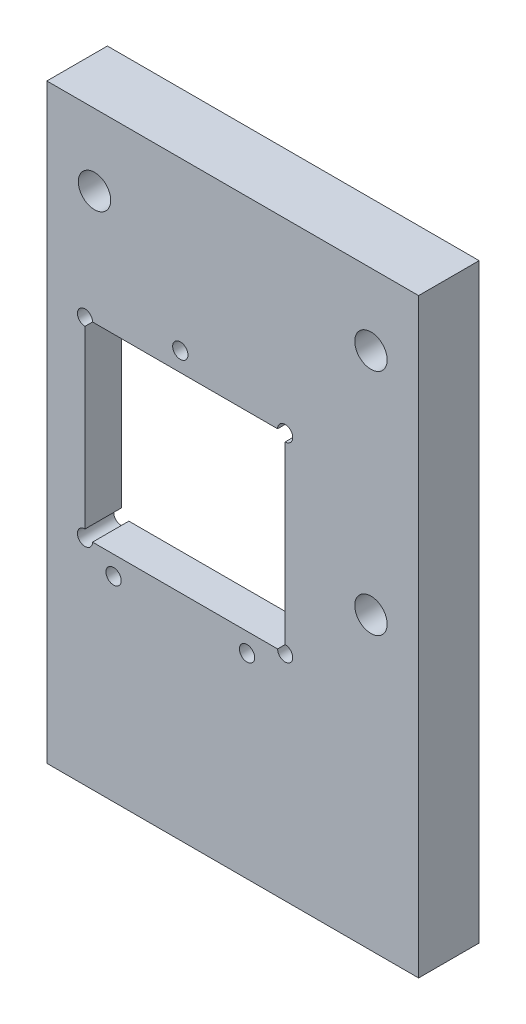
ISO-10303-21;
HEADER;
FILE_DESCRIPTION(('STEP AP214'),'2;1');
FILE_NAME('part.step','',(''),(''),'','','');
FILE_SCHEMA(('AUTOMOTIVE_DESIGN { 1 0 10303 214 1 1 1 1 }'));
ENDSEC;
DATA;
#1=APPLICATION_CONTEXT('core data for automotive mechanical design processes');
#2=APPLICATION_PROTOCOL_DEFINITION('international standard','automotive_design',2000,#1);
#3=PRODUCT_CONTEXT('',#1,'mechanical');
#4=PRODUCT('Part','Part','',(#3));
#5=PRODUCT_RELATED_PRODUCT_CATEGORY('part','',(#4));
#6=PRODUCT_DEFINITION_FORMATION('','',#4);
#7=PRODUCT_DEFINITION_CONTEXT('part definition',#1,'design');
#8=PRODUCT_DEFINITION('design','',#6,#7);
#9=PRODUCT_DEFINITION_SHAPE('','',#8);
#10=(LENGTH_UNIT() NAMED_UNIT(*) SI_UNIT(.MILLI.,.METRE.));
#11=(NAMED_UNIT(*) PLANE_ANGLE_UNIT() SI_UNIT($,.RADIAN.));
#12=(NAMED_UNIT(*) SI_UNIT($,.STERADIAN.) SOLID_ANGLE_UNIT());
#13=UNCERTAINTY_MEASURE_WITH_UNIT(LENGTH_MEASURE(1.E-05),#10,'distance_accuracy_value','');
#14=(GEOMETRIC_REPRESENTATION_CONTEXT(3) GLOBAL_UNCERTAINTY_ASSIGNED_CONTEXT((#13)) GLOBAL_UNIT_ASSIGNED_CONTEXT((#10,
#11,#12)) REPRESENTATION_CONTEXT('',''));
#15=CARTESIAN_POINT('',(0.,0.,0.));
#16=DIRECTION('',(0.,0.,1.));
#17=DIRECTION('',(1.,0.,0.));
#18=AXIS2_PLACEMENT_3D('',#15,#16,#17);
#19=CARTESIAN_POINT('',(1.49999999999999,-10.5,6.35));
#20=DIRECTION('',(0.,0.,1.));
#21=DIRECTION('',(1.,0.,0.));
#22=AXIS2_PLACEMENT_3D('',#19,#20,#21);
#23=CYLINDRICAL_SURFACE('',#22,0.799999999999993);
#24=CARTESIAN_POINT('',(1.49999999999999,-10.5,6.35));
#25=DIRECTION('',(0.,0.,1.));
#26=DIRECTION('',(1.,0.,0.));
#27=AXIS2_PLACEMENT_3D('',#24,#25,#26);
#28=CIRCLE('',#27,0.799999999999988);
#29=CARTESIAN_POINT('',(2.29999999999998,-10.5,6.35));
#30=VERTEX_POINT('',#29);
#31=EDGE_CURVE('E306',#30,#30,#28,.T.);
#32=ORIENTED_EDGE('',*,*,#31,.T.);
#33=EDGE_LOOP('',(#32));
#34=FACE_BOUND('',#33,.T.);
#35=CARTESIAN_POINT('',(1.49999999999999,-10.5,2.54));
#36=DIRECTION('',(0.,0.,-1.));
#37=DIRECTION('',(-1.,0.,0.));
#38=AXIS2_PLACEMENT_3D('',#35,#36,#37);
#39=CIRCLE('',#38,0.799999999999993);
#40=CARTESIAN_POINT('',(0.699999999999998,-10.5,2.54));
#41=VERTEX_POINT('',#40);
#42=EDGE_CURVE('E239',#41,#41,#39,.F.);
#43=ORIENTED_EDGE('',*,*,#42,.F.);
#44=EDGE_LOOP('',(#43));
#45=FACE_BOUND('',#44,.T.);
#46=ADVANCED_FACE('F37',(#34,#45),#23,.F.);
#47=CARTESIAN_POINT('',(-12.5,-10.5,6.35));
#48=DIRECTION('',(0.,0.,1.));
#49=DIRECTION('',(1.,0.,0.));
#50=AXIS2_PLACEMENT_3D('',#47,#48,#49);
#51=CYLINDRICAL_SURFACE('',#50,0.799999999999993);
#52=CARTESIAN_POINT('',(-12.5,-10.5,6.35));
#53=DIRECTION('',(0.,0.,1.));
#54=DIRECTION('',(1.,0.,0.));
#55=AXIS2_PLACEMENT_3D('',#52,#53,#54);
#56=CIRCLE('',#55,0.799999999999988);
#57=CARTESIAN_POINT('',(-11.7,-10.5,6.35));
#58=VERTEX_POINT('',#57);
#59=EDGE_CURVE('E303',#58,#58,#56,.T.);
#60=ORIENTED_EDGE('',*,*,#59,.T.);
#61=EDGE_LOOP('',(#60));
#62=FACE_BOUND('',#61,.T.);
#63=CARTESIAN_POINT('',(-12.5,-10.5,2.54));
#64=DIRECTION('',(0.,0.,-1.));
#65=DIRECTION('',(-1.,0.,0.));
#66=AXIS2_PLACEMENT_3D('',#63,#64,#65);
#67=CIRCLE('',#66,0.799999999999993);
#68=CARTESIAN_POINT('',(-13.3,-10.5,2.54));
#69=VERTEX_POINT('',#68);
#70=EDGE_CURVE('E236',#69,#69,#67,.F.);
#71=ORIENTED_EDGE('',*,*,#70,.F.);
#72=EDGE_LOOP('',(#71));
#73=FACE_BOUND('',#72,.T.);
#74=ADVANCED_FACE('F465',(#62,#73),#51,.F.);
#75=CARTESIAN_POINT('',(-5.50000000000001,13.5,6.35));
#76=DIRECTION('',(0.,0.,1.));
#77=DIRECTION('',(1.,0.,0.));
#78=AXIS2_PLACEMENT_3D('',#75,#76,#77);
#79=CYLINDRICAL_SURFACE('',#78,0.799999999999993);
#80=CARTESIAN_POINT('',(-5.50000000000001,13.5,6.35));
#81=DIRECTION('',(0.,0.,1.));
#82=DIRECTION('',(1.,0.,0.));
#83=AXIS2_PLACEMENT_3D('',#80,#81,#82);
#84=CIRCLE('',#83,0.799999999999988);
#85=CARTESIAN_POINT('',(-4.70000000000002,13.5,6.35));
#86=VERTEX_POINT('',#85);
#87=EDGE_CURVE('E300',#86,#86,#84,.T.);
#88=ORIENTED_EDGE('',*,*,#87,.T.);
#89=EDGE_LOOP('',(#88));
#90=FACE_BOUND('',#89,.T.);
#91=CARTESIAN_POINT('',(-5.50000000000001,13.5,2.54));
#92=DIRECTION('',(0.,0.,-1.));
#93=DIRECTION('',(-1.,0.,0.));
#94=AXIS2_PLACEMENT_3D('',#91,#92,#93);
#95=CIRCLE('',#94,0.799999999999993);
#96=CARTESIAN_POINT('',(-6.3,13.5,2.54));
#97=VERTEX_POINT('',#96);
#98=EDGE_CURVE('E233',#97,#97,#95,.F.);
#99=ORIENTED_EDGE('',*,*,#98,.F.);
#100=EDGE_LOOP('',(#99));
#101=FACE_BOUND('',#100,.T.);
#102=ADVANCED_FACE('F471',(#90,#101),#79,.F.);
#103=CARTESIAN_POINT('',(-15.5,11.5,0.));
#104=DIRECTION('',(-1.,0.,0.));
#105=DIRECTION('',(0.,-1.,0.));
#106=AXIS2_PLACEMENT_3D('',#103,#104,#105);
#107=PLANE('',#106);
#108=DIRECTION('',(0.,-1.,0.));
#109=VECTOR('',#108,1.);
#110=CARTESIAN_POINT('',(-15.5,11.5,2.54));
#111=LINE('',#110,#109);
#112=CARTESIAN_POINT('',(-15.5,10.70625,2.54));
#113=VERTEX_POINT('',#112);
#114=CARTESIAN_POINT('',(-15.5,-7.70625000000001,2.54));
#115=VERTEX_POINT('',#114);
#116=EDGE_CURVE('E221',#113,#115,#111,.T.);
#117=ORIENTED_EDGE('',*,*,#116,.F.);
#118=DIRECTION('',(0.,0.,1.));
#119=VECTOR('',#118,1.);
#120=CARTESIAN_POINT('',(-15.5,10.70625,6.35));
#121=LINE('',#120,#119);
#122=CARTESIAN_POINT('',(-15.5,10.70625,6.35));
#123=VERTEX_POINT('',#122);
#124=EDGE_CURVE('E271',#113,#123,#121,.T.);
#125=ORIENTED_EDGE('',*,*,#124,.T.);
#126=DIRECTION('',(0.,-1.,0.));
#127=VECTOR('',#126,1.);
#128=CARTESIAN_POINT('',(-15.5,11.5,6.35));
#129=LINE('',#128,#127);
#130=CARTESIAN_POINT('',(-15.5,-7.70625000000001,6.35));
#131=VERTEX_POINT('',#130);
#132=EDGE_CURVE('E289',#123,#131,#129,.T.);
#133=ORIENTED_EDGE('',*,*,#132,.T.);
#134=DIRECTION('',(0.,0.,1.));
#135=VECTOR('',#134,1.);
#136=CARTESIAN_POINT('',(-15.5,-7.70625000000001,6.35));
#137=LINE('',#136,#135);
#138=EDGE_CURVE('E286',#131,#115,#137,.F.);
#139=ORIENTED_EDGE('',*,*,#138,.T.);
#140=EDGE_LOOP('',(#117,#125,#133,#139));
#141=FACE_BOUND('',#140,.T.);
#142=ADVANCED_FACE('F427',(#141),#107,.F.);
#143=CARTESIAN_POINT('',(-15.5,11.5,0.));
#144=DIRECTION('',(0.,1.,0.));
#145=DIRECTION('',(-1.,0.,0.));
#146=AXIS2_PLACEMENT_3D('',#143,#144,#145);
#147=PLANE('',#146);
#148=DIRECTION('',(-1.,0.,0.));
#149=VECTOR('',#148,1.);
#150=CARTESIAN_POINT('',(-15.5,11.5,2.54));
#151=LINE('',#150,#149);
#152=CARTESIAN_POINT('',(4.70624999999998,11.5,2.54));
#153=VERTEX_POINT('',#152);
#154=CARTESIAN_POINT('',(-14.70625,11.5,2.54));
#155=VERTEX_POINT('',#154);
#156=EDGE_CURVE('E214',#153,#155,#151,.T.);
#157=ORIENTED_EDGE('',*,*,#156,.F.);
#158=DIRECTION('',(0.,0.,1.));
#159=VECTOR('',#158,1.);
#160=CARTESIAN_POINT('',(4.70624999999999,11.5,6.35));
#161=LINE('',#160,#159);
#162=CARTESIAN_POINT('',(4.70624999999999,11.5,6.35));
#163=VERTEX_POINT('',#162);
#164=EDGE_CURVE('E276',#153,#163,#161,.T.);
#165=ORIENTED_EDGE('',*,*,#164,.T.);
#166=DIRECTION('',(-1.,0.,0.));
#167=VECTOR('',#166,1.);
#168=CARTESIAN_POINT('',(-15.5,11.5,6.35));
#169=LINE('',#168,#167);
#170=CARTESIAN_POINT('',(-14.70625,11.5,6.35));
#171=VERTEX_POINT('',#170);
#172=EDGE_CURVE('E297',#163,#171,#169,.T.);
#173=ORIENTED_EDGE('',*,*,#172,.T.);
#174=DIRECTION('',(0.,0.,1.));
#175=VECTOR('',#174,1.);
#176=CARTESIAN_POINT('',(-14.70625,11.5,6.35));
#177=LINE('',#176,#175);
#178=EDGE_CURVE('E349',#171,#155,#177,.F.);
#179=ORIENTED_EDGE('',*,*,#178,.T.);
#180=EDGE_LOOP('',(#157,#165,#173,#179));
#181=FACE_BOUND('',#180,.T.);
#182=ADVANCED_FACE('F454',(#181),#147,.F.);
#183=CARTESIAN_POINT('',(5.49999999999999,11.5,0.));
#184=DIRECTION('',(1.,0.,0.));
#185=DIRECTION('',(0.,1.,0.));
#186=AXIS2_PLACEMENT_3D('',#183,#184,#185);
#187=PLANE('',#186);
#188=DIRECTION('',(0.,1.,0.));
#189=VECTOR('',#188,1.);
#190=CARTESIAN_POINT('',(5.49999999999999,11.5,2.54));
#191=LINE('',#190,#189);
#192=CARTESIAN_POINT('',(5.49999999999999,-7.70625000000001,2.54));
#193=VERTEX_POINT('',#192);
#194=CARTESIAN_POINT('',(5.49999999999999,10.70625,2.54));
#195=VERTEX_POINT('',#194);
#196=EDGE_CURVE('E229',#193,#195,#191,.T.);
#197=ORIENTED_EDGE('',*,*,#196,.F.);
#198=DIRECTION('',(0.,0.,1.));
#199=VECTOR('',#198,1.);
#200=CARTESIAN_POINT('',(5.49999999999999,-7.70625000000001,6.35));
#201=LINE('',#200,#199);
#202=CARTESIAN_POINT('',(5.49999999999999,-7.70625000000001,6.35));
#203=VERTEX_POINT('',#202);
#204=EDGE_CURVE('E281',#193,#203,#201,.T.);
#205=ORIENTED_EDGE('',*,*,#204,.T.);
#206=DIRECTION('',(0.,1.,0.));
#207=VECTOR('',#206,1.);
#208=CARTESIAN_POINT('',(5.49999999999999,11.5,6.35));
#209=LINE('',#208,#207);
#210=CARTESIAN_POINT('',(5.49999999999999,10.70625,6.35));
#211=VERTEX_POINT('',#210);
#212=EDGE_CURVE('E294',#203,#211,#209,.T.);
#213=ORIENTED_EDGE('',*,*,#212,.T.);
#214=DIRECTION('',(0.,0.,1.));
#215=VECTOR('',#214,1.);
#216=CARTESIAN_POINT('',(5.49999999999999,10.70625,6.35));
#217=LINE('',#216,#215);
#218=EDGE_CURVE('E346',#211,#195,#217,.F.);
#219=ORIENTED_EDGE('',*,*,#218,.T.);
#220=EDGE_LOOP('',(#197,#205,#213,#219));
#221=FACE_BOUND('',#220,.T.);
#222=ADVANCED_FACE('F447',(#221),#187,.F.);
#223=CARTESIAN_POINT('',(-15.5,-8.50000000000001,0.));
#224=DIRECTION('',(0.,-1.,0.));
#225=DIRECTION('',(0.,0.,-1.));
#226=AXIS2_PLACEMENT_3D('',#223,#224,#225);
#227=PLANE('',#226);
#228=DIRECTION('',(1.,0.,0.));
#229=VECTOR('',#228,1.);
#230=CARTESIAN_POINT('',(-15.5,-8.50000000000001,2.54));
#231=LINE('',#230,#229);
#232=CARTESIAN_POINT('',(-14.70625,-8.50000000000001,2.54));
#233=VERTEX_POINT('',#232);
#234=CARTESIAN_POINT('',(4.70625,-8.50000000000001,2.54));
#235=VERTEX_POINT('',#234);
#236=EDGE_CURVE('E227',#233,#235,#231,.T.);
#237=ORIENTED_EDGE('',*,*,#236,.F.);
#238=DIRECTION('',(0.,0.,1.));
#239=VECTOR('',#238,1.);
#240=CARTESIAN_POINT('',(-14.70625,-8.50000000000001,6.35));
#241=LINE('',#240,#239);
#242=CARTESIAN_POINT('',(-14.70625,-8.50000000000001,6.35));
#243=VERTEX_POINT('',#242);
#244=EDGE_CURVE('E341',#233,#243,#241,.T.);
#245=ORIENTED_EDGE('',*,*,#244,.T.);
#246=DIRECTION('',(1.,0.,0.));
#247=VECTOR('',#246,1.);
#248=CARTESIAN_POINT('',(-15.5,-8.50000000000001,6.35));
#249=LINE('',#248,#247);
#250=CARTESIAN_POINT('',(4.70624999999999,-8.50000000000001,6.35));
#251=VERTEX_POINT('',#250);
#252=EDGE_CURVE('E291',#243,#251,#249,.T.);
#253=ORIENTED_EDGE('',*,*,#252,.T.);
#254=DIRECTION('',(0.,0.,1.));
#255=VECTOR('',#254,1.);
#256=CARTESIAN_POINT('',(4.70624999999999,-8.50000000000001,6.35));
#257=LINE('',#256,#255);
#258=EDGE_CURVE('E343',#251,#235,#257,.F.);
#259=ORIENTED_EDGE('',*,*,#258,.T.);
#260=EDGE_LOOP('',(#237,#245,#253,#259));
#261=FACE_BOUND('',#260,.T.);
#262=ADVANCED_FACE('F438',(#261),#227,.F.);
#263=CARTESIAN_POINT('',(-15.5,-8.50000000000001,6.35));
#264=DIRECTION('',(0.,0.,1.));
#265=DIRECTION('',(1.,0.,0.));
#266=AXIS2_PLACEMENT_3D('',#263,#264,#265);
#267=CYLINDRICAL_SURFACE('',#266,0.793749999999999);
#268=CARTESIAN_POINT('',(-15.5,-8.50000000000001,2.54));
#269=DIRECTION('',(0.,0.,-1.));
#270=DIRECTION('',(-1.,0.,0.));
#271=AXIS2_PLACEMENT_3D('',#268,#269,#270);
#272=CIRCLE('',#271,0.793749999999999);
#273=EDGE_CURVE('E225',#115,#233,#272,.F.);
#274=ORIENTED_EDGE('',*,*,#273,.F.);
#275=ORIENTED_EDGE('',*,*,#138,.F.);
#276=CARTESIAN_POINT('',(-15.5,-8.50000000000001,6.35));
#277=DIRECTION('',(0.,0.,1.));
#278=DIRECTION('',(1.,0.,0.));
#279=AXIS2_PLACEMENT_3D('',#276,#277,#278);
#280=CIRCLE('',#279,0.793749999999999);
#281=EDGE_CURVE('E283',#131,#243,#280,.T.);
#282=ORIENTED_EDGE('',*,*,#281,.T.);
#283=ORIENTED_EDGE('',*,*,#244,.F.);
#284=EDGE_LOOP('',(#274,#275,#282,#283));
#285=FACE_BOUND('',#284,.T.);
#286=ADVANCED_FACE('F431',(#285),#267,.F.);
#287=CARTESIAN_POINT('',(5.49999999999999,-8.50000000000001,6.35));
#288=DIRECTION('',(0.,0.,1.));
#289=DIRECTION('',(1.,0.,0.));
#290=AXIS2_PLACEMENT_3D('',#287,#288,#289);
#291=CYLINDRICAL_SURFACE('',#290,0.793749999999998);
#292=CARTESIAN_POINT('',(5.49999999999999,-8.50000000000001,2.54));
#293=DIRECTION('',(0.,0.,-1.));
#294=DIRECTION('',(-1.,0.,0.));
#295=AXIS2_PLACEMENT_3D('',#292,#293,#294);
#296=CIRCLE('',#295,0.793749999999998);
#297=EDGE_CURVE('E231',#235,#193,#296,.F.);
#298=ORIENTED_EDGE('',*,*,#297,.F.);
#299=ORIENTED_EDGE('',*,*,#258,.F.);
#300=CARTESIAN_POINT('',(5.49999999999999,-8.50000000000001,6.35));
#301=DIRECTION('',(0.,0.,1.));
#302=DIRECTION('',(1.,0.,0.));
#303=AXIS2_PLACEMENT_3D('',#300,#301,#302);
#304=CIRCLE('',#303,0.793749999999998);
#305=EDGE_CURVE('E278',#251,#203,#304,.T.);
#306=ORIENTED_EDGE('',*,*,#305,.T.);
#307=ORIENTED_EDGE('',*,*,#204,.F.);
#308=EDGE_LOOP('',(#298,#299,#306,#307));
#309=FACE_BOUND('',#308,.T.);
#310=ADVANCED_FACE('F441',(#309),#291,.F.);
#311=CARTESIAN_POINT('',(5.49999999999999,11.5,6.35));
#312=DIRECTION('',(0.,0.,1.));
#313=DIRECTION('',(1.,0.,0.));
#314=AXIS2_PLACEMENT_3D('',#311,#312,#313);
#315=CYLINDRICAL_SURFACE('',#314,0.793749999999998);
#316=CARTESIAN_POINT('',(5.49999999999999,11.5,2.54));
#317=DIRECTION('',(0.,0.,-1.));
#318=DIRECTION('',(-1.,0.,0.));
#319=AXIS2_PLACEMENT_3D('',#316,#317,#318);
#320=CIRCLE('',#319,0.793749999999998);
#321=EDGE_CURVE('E223',#195,#153,#320,.F.);
#322=ORIENTED_EDGE('',*,*,#321,.F.);
#323=ORIENTED_EDGE('',*,*,#218,.F.);
#324=CARTESIAN_POINT('',(5.49999999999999,11.5,6.35));
#325=DIRECTION('',(0.,0.,1.));
#326=DIRECTION('',(1.,0.,0.));
#327=AXIS2_PLACEMENT_3D('',#324,#325,#326);
#328=CIRCLE('',#327,0.793749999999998);
#329=EDGE_CURVE('E273',#211,#163,#328,.T.);
#330=ORIENTED_EDGE('',*,*,#329,.T.);
#331=ORIENTED_EDGE('',*,*,#164,.F.);
#332=EDGE_LOOP('',(#322,#323,#330,#331));
#333=FACE_BOUND('',#332,.T.);
#334=ADVANCED_FACE('F452',(#333),#315,.F.);
#335=CARTESIAN_POINT('',(-15.5,11.5,6.35));
#336=DIRECTION('',(0.,0.,1.));
#337=DIRECTION('',(1.,0.,0.));
#338=AXIS2_PLACEMENT_3D('',#335,#336,#337);
#339=CYLINDRICAL_SURFACE('',#338,0.793749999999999);
#340=CARTESIAN_POINT('',(-15.5,11.5,2.54));
#341=DIRECTION('',(0.,0.,-1.));
#342=DIRECTION('',(-1.,0.,0.));
#343=AXIS2_PLACEMENT_3D('',#340,#341,#342);
#344=CIRCLE('',#343,0.793749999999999);
#345=EDGE_CURVE('E352',#155,#113,#344,.F.);
#346=ORIENTED_EDGE('',*,*,#345,.F.);
#347=ORIENTED_EDGE('',*,*,#178,.F.);
#348=CARTESIAN_POINT('',(-15.5,11.5,6.35));
#349=DIRECTION('',(0.,0.,1.));
#350=DIRECTION('',(1.,0.,0.));
#351=AXIS2_PLACEMENT_3D('',#348,#349,#350);
#352=CIRCLE('',#351,0.793749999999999);
#353=EDGE_CURVE('E266',#171,#123,#352,.T.);
#354=ORIENTED_EDGE('',*,*,#353,.T.);
#355=ORIENTED_EDGE('',*,*,#124,.F.);
#356=EDGE_LOOP('',(#346,#347,#354,#355));
#357=FACE_BOUND('',#356,.T.);
#358=ADVANCED_FACE('F410',(#357),#339,.F.);
#359=CARTESIAN_POINT('',(0.,0.,6.35));
#360=DIRECTION('',(0.,0.,-1.));
#361=DIRECTION('',(-1.,0.,0.));
#362=AXIS2_PLACEMENT_3D('',#359,#360,#361);
#363=PLANE('',#362);
#364=CARTESIAN_POINT('',(-14.5,23.5,6.35));
#365=DIRECTION('',(0.,0.,1.));
#366=DIRECTION('',(1.,0.,0.));
#367=AXIS2_PLACEMENT_3D('',#364,#365,#366);
#368=CIRCLE('',#367,1.7);
#369=CARTESIAN_POINT('',(-12.8,23.5,6.35));
#370=VERTEX_POINT('',#369);
#371=EDGE_CURVE('E250',#370,#370,#368,.T.);
#372=ORIENTED_EDGE('',*,*,#371,.F.);
#373=EDGE_LOOP('',(#372));
#374=FACE_BOUND('',#373,.T.);
#375=CARTESIAN_POINT('',(14.5,23.5,6.35));
#376=DIRECTION('',(0.,0.,1.));
#377=DIRECTION('',(1.,0.,0.));
#378=AXIS2_PLACEMENT_3D('',#375,#376,#377);
#379=CIRCLE('',#378,1.69999999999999);
#380=CARTESIAN_POINT('',(16.2,23.5,6.35));
#381=VERTEX_POINT('',#380);
#382=EDGE_CURVE('E254',#381,#381,#379,.T.);
#383=ORIENTED_EDGE('',*,*,#382,.F.);
#384=EDGE_LOOP('',(#383));
#385=FACE_BOUND('',#384,.T.);
#386=CARTESIAN_POINT('',(14.5,-0.500000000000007,6.35));
#387=DIRECTION('',(0.,0.,1.));
#388=DIRECTION('',(1.,0.,0.));
#389=AXIS2_PLACEMENT_3D('',#386,#387,#388);
#390=CIRCLE('',#389,1.7);
#391=CARTESIAN_POINT('',(16.2,-0.500000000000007,6.35));
#392=VERTEX_POINT('',#391);
#393=EDGE_CURVE('E260',#392,#392,#390,.T.);
#394=ORIENTED_EDGE('',*,*,#393,.F.);
#395=EDGE_LOOP('',(#394));
#396=FACE_BOUND('',#395,.T.);
#397=DIRECTION('',(0.,1.,0.));
#398=VECTOR('',#397,1.);
#399=CARTESIAN_POINT('',(19.5,-31.,6.35));
#400=LINE('',#399,#398);
#401=CARTESIAN_POINT('',(19.5,-31.,6.35));
#402=VERTEX_POINT('',#401);
#403=CARTESIAN_POINT('',(19.5,31.,6.35));
#404=VERTEX_POINT('',#403);
#405=EDGE_CURVE('E310',#402,#404,#400,.T.);
#406=ORIENTED_EDGE('',*,*,#405,.T.);
#407=DIRECTION('',(-1.,0.,0.));
#408=VECTOR('',#407,1.);
#409=CARTESIAN_POINT('',(-19.5,31.,6.35));
#410=LINE('',#409,#408);
#411=CARTESIAN_POINT('',(-19.5,31.,6.35));
#412=VERTEX_POINT('',#411);
#413=EDGE_CURVE('E313',#404,#412,#410,.T.);
#414=ORIENTED_EDGE('',*,*,#413,.T.);
#415=DIRECTION('',(0.,-1.,0.));
#416=VECTOR('',#415,1.);
#417=CARTESIAN_POINT('',(-19.5,-31.,6.35));
#418=LINE('',#417,#416);
#419=CARTESIAN_POINT('',(-19.5,-31.,6.35));
#420=VERTEX_POINT('',#419);
#421=EDGE_CURVE('E316',#412,#420,#418,.T.);
#422=ORIENTED_EDGE('',*,*,#421,.T.);
#423=DIRECTION('',(1.,0.,0.));
#424=VECTOR('',#423,1.);
#425=CARTESIAN_POINT('',(-19.5,-31.,6.35));
#426=LINE('',#425,#424);
#427=EDGE_CURVE('E318',#420,#402,#426,.T.);
#428=ORIENTED_EDGE('',*,*,#427,.T.);
#429=EDGE_LOOP('',(#406,#414,#422,#428));
#430=FACE_BOUND('',#429,.T.);
#431=ORIENTED_EDGE('',*,*,#31,.F.);
#432=EDGE_LOOP('',(#431));
#433=FACE_BOUND('',#432,.T.);
#434=ORIENTED_EDGE('',*,*,#59,.F.);
#435=EDGE_LOOP('',(#434));
#436=FACE_BOUND('',#435,.T.);
#437=ORIENTED_EDGE('',*,*,#87,.F.);
#438=EDGE_LOOP('',(#437));
#439=FACE_BOUND('',#438,.T.);
#440=ORIENTED_EDGE('',*,*,#132,.F.);
#441=ORIENTED_EDGE('',*,*,#353,.F.);
#442=ORIENTED_EDGE('',*,*,#172,.F.);
#443=ORIENTED_EDGE('',*,*,#329,.F.);
#444=ORIENTED_EDGE('',*,*,#212,.F.);
#445=ORIENTED_EDGE('',*,*,#305,.F.);
#446=ORIENTED_EDGE('',*,*,#252,.F.);
#447=ORIENTED_EDGE('',*,*,#281,.F.);
#448=EDGE_LOOP('',(#440,#441,#442,#443,#444,#445,#446,#447));
#449=FACE_BOUND('',#448,.T.);
#450=ADVANCED_FACE('F407',(#374,#385,#396,#430,#433,#436,#439,#449),#363,.F.);
#451=CARTESIAN_POINT('',(19.5,-31.,6.35));
#452=DIRECTION('',(-1.,0.,0.));
#453=DIRECTION('',(0.,0.,1.));
#454=AXIS2_PLACEMENT_3D('',#451,#452,#453);
#455=PLANE('',#454);
#456=DIRECTION('',(0.,1.,0.));
#457=VECTOR('',#456,1.);
#458=CARTESIAN_POINT('',(19.5,-31.,0.));
#459=LINE('',#458,#457);
#460=CARTESIAN_POINT('',(19.5,-31.,0.));
#461=VERTEX_POINT('',#460);
#462=CARTESIAN_POINT('',(19.5,31.,0.));
#463=VERTEX_POINT('',#462);
#464=EDGE_CURVE('E309',#461,#463,#459,.T.);
#465=ORIENTED_EDGE('',*,*,#464,.T.);
#466=DIRECTION('',(0.,0.,-1.));
#467=VECTOR('',#466,1.);
#468=CARTESIAN_POINT('',(19.5,31.,6.35));
#469=LINE('',#468,#467);
#470=EDGE_CURVE('E338',#404,#463,#469,.T.);
#471=ORIENTED_EDGE('',*,*,#470,.F.);
#472=ORIENTED_EDGE('',*,*,#405,.F.);
#473=DIRECTION('',(0.,0.,-1.));
#474=VECTOR('',#473,1.);
#475=CARTESIAN_POINT('',(19.5,-31.,6.35));
#476=LINE('',#475,#474);
#477=EDGE_CURVE('E320',#402,#461,#476,.T.);
#478=ORIENTED_EDGE('',*,*,#477,.T.);
#479=EDGE_LOOP('',(#465,#471,#472,#478));
#480=FACE_BOUND('',#479,.T.);
#481=ADVANCED_FACE('F400',(#480),#455,.F.);
#482=CARTESIAN_POINT('',(-19.5,31.,6.35));
#483=DIRECTION('',(0.,-1.,0.));
#484=DIRECTION('',(0.,0.,-1.));
#485=AXIS2_PLACEMENT_3D('',#482,#483,#484);
#486=PLANE('',#485);
#487=DIRECTION('',(-1.,0.,0.));
#488=VECTOR('',#487,1.);
#489=CARTESIAN_POINT('',(-19.5,31.,0.));
#490=LINE('',#489,#488);
#491=CARTESIAN_POINT('',(-19.5,31.,0.));
#492=VERTEX_POINT('',#491);
#493=EDGE_CURVE('E323',#463,#492,#490,.T.);
#494=ORIENTED_EDGE('',*,*,#493,.T.);
#495=DIRECTION('',(0.,0.,-1.));
#496=VECTOR('',#495,1.);
#497=CARTESIAN_POINT('',(-19.5,31.,6.35));
#498=LINE('',#497,#496);
#499=EDGE_CURVE('E335',#412,#492,#498,.T.);
#500=ORIENTED_EDGE('',*,*,#499,.F.);
#501=ORIENTED_EDGE('',*,*,#413,.F.);
#502=ORIENTED_EDGE('',*,*,#470,.T.);
#503=EDGE_LOOP('',(#494,#500,#501,#502));
#504=FACE_BOUND('',#503,.T.);
#505=ADVANCED_FACE('F395',(#504),#486,.F.);
#506=CARTESIAN_POINT('',(-19.5,-31.,6.35));
#507=DIRECTION('',(1.,0.,0.));
#508=DIRECTION('',(0.,0.,-1.));
#509=AXIS2_PLACEMENT_3D('',#506,#507,#508);
#510=PLANE('',#509);
#511=DIRECTION('',(0.,-1.,0.));
#512=VECTOR('',#511,1.);
#513=CARTESIAN_POINT('',(-19.5,-31.,0.));
#514=LINE('',#513,#512);
#515=CARTESIAN_POINT('',(-19.5,17.,0.));
#516=VERTEX_POINT('',#515);
#517=EDGE_CURVE('E326',#492,#516,#514,.T.);
#518=ORIENTED_EDGE('',*,*,#517,.T.);
#519=DIRECTION('',(0.,0.,1.));
#520=VECTOR('',#519,1.);
#521=CARTESIAN_POINT('',(-19.5,17.,6.35));
#522=LINE('',#521,#520);
#523=CARTESIAN_POINT('',(-19.5,17.,2.54));
#524=VERTEX_POINT('',#523);
#525=EDGE_CURVE('E247',#516,#524,#522,.T.);
#526=ORIENTED_EDGE('',*,*,#525,.T.);
#527=DIRECTION('',(0.,1.,0.));
#528=VECTOR('',#527,1.);
#529=CARTESIAN_POINT('',(-19.5,-31.,2.54));
#530=LINE('',#529,#528);
#531=CARTESIAN_POINT('',(-19.5,-14.,2.54));
#532=VERTEX_POINT('',#531);
#533=EDGE_CURVE('E242',#532,#524,#530,.T.);
#534=ORIENTED_EDGE('',*,*,#533,.F.);
#535=DIRECTION('',(0.,0.,-1.));
#536=VECTOR('',#535,1.);
#537=CARTESIAN_POINT('',(-19.5,-14.,6.35));
#538=LINE('',#537,#536);
#539=CARTESIAN_POINT('',(-19.5,-14.,0.));
#540=VERTEX_POINT('',#539);
#541=EDGE_CURVE('E244',#532,#540,#538,.T.);
#542=ORIENTED_EDGE('',*,*,#541,.T.);
#543=CARTESIAN_POINT('',(-19.5,-31.,0.));
#544=VERTEX_POINT('',#543);
#545=EDGE_CURVE('E325',#540,#544,#514,.T.);
#546=ORIENTED_EDGE('',*,*,#545,.T.);
#547=DIRECTION('',(0.,0.,-1.));
#548=VECTOR('',#547,1.);
#549=CARTESIAN_POINT('',(-19.5,-31.,6.35));
#550=LINE('',#549,#548);
#551=EDGE_CURVE('E332',#420,#544,#550,.T.);
#552=ORIENTED_EDGE('',*,*,#551,.F.);
#553=ORIENTED_EDGE('',*,*,#421,.F.);
#554=ORIENTED_EDGE('',*,*,#499,.T.);
#555=EDGE_LOOP('',(#518,#526,#534,#542,#546,#552,#553,#554));
#556=FACE_BOUND('',#555,.T.);
#557=ADVANCED_FACE('F387',(#556),#510,.F.);
#558=CARTESIAN_POINT('',(-19.5,-31.,6.35));
#559=DIRECTION('',(0.,1.,0.));
#560=DIRECTION('',(0.,0.,1.));
#561=AXIS2_PLACEMENT_3D('',#558,#559,#560);
#562=PLANE('',#561);
#563=CARTESIAN_POINT('',(-13.15,-31.,3.175));
#564=DIRECTION('',(0.,-1.,0.));
#565=DIRECTION('',(0.,0.,-1.));
#566=AXIS2_PLACEMENT_3D('',#563,#564,#565);
#567=CIRCLE('',#566,1.1303);
#568=CARTESIAN_POINT('',(-13.15,-31.,2.0447));
#569=VERTEX_POINT('',#568);
#570=EDGE_CURVE('E183',#569,#569,#567,.T.);
#571=ORIENTED_EDGE('',*,*,#570,.F.);
#572=EDGE_LOOP('',(#571));
#573=FACE_BOUND('',#572,.T.);
#574=CARTESIAN_POINT('',(13.15,-31.,3.175));
#575=DIRECTION('',(0.,-1.,0.));
#576=DIRECTION('',(0.,0.,-1.));
#577=AXIS2_PLACEMENT_3D('',#574,#575,#576);
#578=CIRCLE('',#577,1.1303);
#579=CARTESIAN_POINT('',(13.15,-31.,2.0447));
#580=VERTEX_POINT('',#579);
#581=EDGE_CURVE('E182',#580,#580,#578,.T.);
#582=ORIENTED_EDGE('',*,*,#581,.F.);
#583=EDGE_LOOP('',(#582));
#584=FACE_BOUND('',#583,.T.);
#585=CARTESIAN_POINT('',(-6.80000000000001,-31.,3.175));
#586=DIRECTION('',(0.,-1.,0.));
#587=DIRECTION('',(0.,0.,-1.));
#588=AXIS2_PLACEMENT_3D('',#585,#586,#587);
#589=CIRCLE('',#588,1.5875);
#590=CARTESIAN_POINT('',(-6.80000000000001,-31.,1.5875));
#591=VERTEX_POINT('',#590);
#592=EDGE_CURVE('E193',#591,#591,#589,.T.);
#593=ORIENTED_EDGE('',*,*,#592,.F.);
#594=EDGE_LOOP('',(#593));
#595=FACE_BOUND('',#594,.T.);
#596=CARTESIAN_POINT('',(6.79999999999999,-31.,3.175));
#597=DIRECTION('',(0.,-1.,0.));
#598=DIRECTION('',(0.,0.,-1.));
#599=AXIS2_PLACEMENT_3D('',#596,#597,#598);
#600=CIRCLE('',#599,1.5875);
#601=CARTESIAN_POINT('',(6.79999999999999,-31.,1.5875));
#602=VERTEX_POINT('',#601);
#603=EDGE_CURVE('E199',#602,#602,#600,.T.);
#604=ORIENTED_EDGE('',*,*,#603,.F.);
#605=EDGE_LOOP('',(#604));
#606=FACE_BOUND('',#605,.T.);
#607=DIRECTION('',(1.,0.,0.));
#608=VECTOR('',#607,1.);
#609=CARTESIAN_POINT('',(-19.5,-31.,0.));
#610=LINE('',#609,#608);
#611=EDGE_CURVE('E314',#544,#461,#610,.T.);
#612=ORIENTED_EDGE('',*,*,#611,.T.);
#613=ORIENTED_EDGE('',*,*,#477,.F.);
#614=ORIENTED_EDGE('',*,*,#427,.F.);
#615=ORIENTED_EDGE('',*,*,#551,.T.);
#616=EDGE_LOOP('',(#612,#613,#614,#615));
#617=FACE_BOUND('',#616,.T.);
#618=ADVANCED_FACE('F405',(#573,#584,#595,#606,#617),#562,.F.);
#619=CARTESIAN_POINT('',(0.,0.,0.));
#620=DIRECTION('',(0.,0.,-1.));
#621=DIRECTION('',(-1.,0.,0.));
#622=AXIS2_PLACEMENT_3D('',#619,#620,#621);
#623=PLANE('',#622);
#624=DIRECTION('',(1.,0.,0.));
#625=VECTOR('',#624,1.);
#626=CARTESIAN_POINT('',(10.5,17.,0.));
#627=LINE('',#626,#625);
#628=CARTESIAN_POINT('',(9.49999999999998,17.,0.));
#629=VERTEX_POINT('',#628);
#630=EDGE_CURVE('E210',#516,#629,#627,.T.);
#631=ORIENTED_EDGE('',*,*,#630,.F.);
#632=ORIENTED_EDGE('',*,*,#517,.F.);
#633=ORIENTED_EDGE('',*,*,#493,.F.);
#634=ORIENTED_EDGE('',*,*,#464,.F.);
#635=ORIENTED_EDGE('',*,*,#611,.F.);
#636=ORIENTED_EDGE('',*,*,#545,.F.);
#637=DIRECTION('',(-1.,0.,0.));
#638=VECTOR('',#637,1.);
#639=CARTESIAN_POINT('',(10.5,-14.,0.));
#640=LINE('',#639,#638);
#641=CARTESIAN_POINT('',(9.49999999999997,-14.,0.));
#642=VERTEX_POINT('',#641);
#643=EDGE_CURVE('E217',#642,#540,#640,.T.);
#644=ORIENTED_EDGE('',*,*,#643,.F.);
#645=CARTESIAN_POINT('',(9.49999999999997,-13.,0.));
#646=DIRECTION('',(0.,0.,-1.));
#647=DIRECTION('',(-1.,0.,0.));
#648=AXIS2_PLACEMENT_3D('',#645,#646,#647);
#649=CIRCLE('',#648,1.);
#650=CARTESIAN_POINT('',(10.5,-13.,0.));
#651=VERTEX_POINT('',#650);
#652=EDGE_CURVE('E45',#642,#651,#649,.F.);
#653=ORIENTED_EDGE('',*,*,#652,.T.);
#654=DIRECTION('',(0.,-1.,0.));
#655=VECTOR('',#654,1.);
#656=CARTESIAN_POINT('',(10.5,17.,0.));
#657=LINE('',#656,#655);
#658=CARTESIAN_POINT('',(10.5,16.,0.));
#659=VERTEX_POINT('',#658);
#660=EDGE_CURVE('E205',#659,#651,#657,.T.);
#661=ORIENTED_EDGE('',*,*,#660,.F.);
#662=CARTESIAN_POINT('',(9.49999999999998,16.,0.));
#663=DIRECTION('',(0.,0.,-1.));
#664=DIRECTION('',(-1.,0.,0.));
#665=AXIS2_PLACEMENT_3D('',#662,#663,#664);
#666=CIRCLE('',#665,1.);
#667=EDGE_CURVE('E11',#659,#629,#666,.F.);
#668=ORIENTED_EDGE('',*,*,#667,.T.);
#669=EDGE_LOOP('',(#631,#632,#633,#634,#635,#636,#644,#653,#661,#668));
#670=FACE_BOUND('',#669,.T.);
#671=CARTESIAN_POINT('',(-14.5,23.5,0.));
#672=DIRECTION('',(0.,0.,1.));
#673=DIRECTION('',(1.,0.,0.));
#674=AXIS2_PLACEMENT_3D('',#671,#672,#673);
#675=CIRCLE('',#674,1.7);
#676=CARTESIAN_POINT('',(-12.8,23.5,0.));
#677=VERTEX_POINT('',#676);
#678=EDGE_CURVE('E251',#677,#677,#675,.T.);
#679=ORIENTED_EDGE('',*,*,#678,.T.);
#680=EDGE_LOOP('',(#679));
#681=FACE_BOUND('',#680,.T.);
#682=CARTESIAN_POINT('',(14.5,23.5,0.));
#683=DIRECTION('',(0.,0.,1.));
#684=DIRECTION('',(1.,0.,0.));
#685=AXIS2_PLACEMENT_3D('',#682,#683,#684);
#686=CIRCLE('',#685,1.69999999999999);
#687=CARTESIAN_POINT('',(16.2,23.5,0.));
#688=VERTEX_POINT('',#687);
#689=EDGE_CURVE('E257',#688,#688,#686,.T.);
#690=ORIENTED_EDGE('',*,*,#689,.T.);
#691=EDGE_LOOP('',(#690));
#692=FACE_BOUND('',#691,.T.);
#693=CARTESIAN_POINT('',(14.5,-0.500000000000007,0.));
#694=DIRECTION('',(0.,0.,1.));
#695=DIRECTION('',(1.,0.,0.));
#696=AXIS2_PLACEMENT_3D('',#693,#694,#695);
#697=CIRCLE('',#696,1.7);
#698=CARTESIAN_POINT('',(16.2,-0.500000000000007,0.));
#699=VERTEX_POINT('',#698);
#700=EDGE_CURVE('E263',#699,#699,#697,.T.);
#701=ORIENTED_EDGE('',*,*,#700,.T.);
#702=EDGE_LOOP('',(#701));
#703=FACE_BOUND('',#702,.T.);
#704=ADVANCED_FACE('F367',(#670,#681,#692,#703),#623,.T.);
#705=CARTESIAN_POINT('',(14.5,-0.500000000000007,0.));
#706=DIRECTION('',(0.,0.,1.));
#707=DIRECTION('',(1.,0.,0.));
#708=AXIS2_PLACEMENT_3D('',#705,#706,#707);
#709=CYLINDRICAL_SURFACE('',#708,1.7);
#710=ORIENTED_EDGE('',*,*,#700,.F.);
#711=EDGE_LOOP('',(#710));
#712=FACE_BOUND('',#711,.T.);
#713=ORIENTED_EDGE('',*,*,#393,.T.);
#714=EDGE_LOOP('',(#713));
#715=FACE_BOUND('',#714,.T.);
#716=ADVANCED_FACE('F479',(#712,#715),#709,.F.);
#717=CARTESIAN_POINT('',(14.5,23.5,0.));
#718=DIRECTION('',(0.,0.,1.));
#719=DIRECTION('',(1.,0.,0.));
#720=AXIS2_PLACEMENT_3D('',#717,#718,#719);
#721=CYLINDRICAL_SURFACE('',#720,1.69999999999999);
#722=ORIENTED_EDGE('',*,*,#689,.F.);
#723=EDGE_LOOP('',(#722));
#724=FACE_BOUND('',#723,.T.);
#725=ORIENTED_EDGE('',*,*,#382,.T.);
#726=EDGE_LOOP('',(#725));
#727=FACE_BOUND('',#726,.T.);
#728=ADVANCED_FACE('F507',(#724,#727),#721,.F.);
#729=CARTESIAN_POINT('',(-14.5,23.5,0.));
#730=DIRECTION('',(0.,0.,1.));
#731=DIRECTION('',(1.,0.,0.));
#732=AXIS2_PLACEMENT_3D('',#729,#730,#731);
#733=CYLINDRICAL_SURFACE('',#732,1.7);
#734=ORIENTED_EDGE('',*,*,#678,.F.);
#735=EDGE_LOOP('',(#734));
#736=FACE_BOUND('',#735,.T.);
#737=ORIENTED_EDGE('',*,*,#371,.T.);
#738=EDGE_LOOP('',(#737));
#739=FACE_BOUND('',#738,.T.);
#740=ADVANCED_FACE('F504',(#736,#739),#733,.F.);
#741=CARTESIAN_POINT('',(10.5,17.,2.54));
#742=DIRECTION('',(0.,1.,0.));
#743=DIRECTION('',(0.,0.,1.));
#744=AXIS2_PLACEMENT_3D('',#741,#742,#743);
#745=PLANE('',#744);
#746=ORIENTED_EDGE('',*,*,#630,.T.);
#747=DIRECTION('',(0.,0.,-1.));
#748=VECTOR('',#747,1.);
#749=CARTESIAN_POINT('',(9.49999999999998,17.,2.54));
#750=LINE('',#749,#748);
#751=CARTESIAN_POINT('',(9.49999999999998,17.,2.54));
#752=VERTEX_POINT('',#751);
#753=EDGE_CURVE('E57',#629,#752,#750,.F.);
#754=ORIENTED_EDGE('',*,*,#753,.T.);
#755=DIRECTION('',(1.,0.,0.));
#756=VECTOR('',#755,1.);
#757=CARTESIAN_POINT('',(10.5,17.,2.54));
#758=LINE('',#757,#756);
#759=EDGE_CURVE('E212',#524,#752,#758,.T.);
#760=ORIENTED_EDGE('',*,*,#759,.F.);
#761=ORIENTED_EDGE('',*,*,#525,.F.);
#762=EDGE_LOOP('',(#746,#754,#760,#761));
#763=FACE_BOUND('',#762,.T.);
#764=ADVANCED_FACE('F389',(#763),#745,.F.);
#765=CARTESIAN_POINT('',(10.5,-14.,2.54));
#766=DIRECTION('',(0.,-1.,0.));
#767=DIRECTION('',(0.,0.,-1.));
#768=AXIS2_PLACEMENT_3D('',#765,#766,#767);
#769=PLANE('',#768);
#770=DIRECTION('',(-1.,0.,0.));
#771=VECTOR('',#770,1.);
#772=CARTESIAN_POINT('',(10.5,-14.,2.54));
#773=LINE('',#772,#771);
#774=CARTESIAN_POINT('',(9.49999999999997,-14.,2.54));
#775=VERTEX_POINT('',#774);
#776=EDGE_CURVE('E209',#775,#532,#773,.T.);
#777=ORIENTED_EDGE('',*,*,#776,.F.);
#778=DIRECTION('',(0.,0.,-1.));
#779=VECTOR('',#778,1.);
#780=CARTESIAN_POINT('',(9.49999999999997,-14.,0.));
#781=LINE('',#780,#779);
#782=EDGE_CURVE('E354',#775,#642,#781,.T.);
#783=ORIENTED_EDGE('',*,*,#782,.T.);
#784=ORIENTED_EDGE('',*,*,#643,.T.);
#785=ORIENTED_EDGE('',*,*,#541,.F.);
#786=EDGE_LOOP('',(#777,#783,#784,#785));
#787=FACE_BOUND('',#786,.T.);
#788=ADVANCED_FACE('F384',(#787),#769,.F.);
#789=CARTESIAN_POINT('',(0.,0.,2.54));
#790=DIRECTION('',(0.,0.,-1.));
#791=DIRECTION('',(-1.,0.,0.));
#792=AXIS2_PLACEMENT_3D('',#789,#790,#791);
#793=PLANE('',#792);
#794=ORIENTED_EDGE('',*,*,#42,.T.);
#795=EDGE_LOOP('',(#794));
#796=FACE_BOUND('',#795,.T.);
#797=ORIENTED_EDGE('',*,*,#98,.T.);
#798=EDGE_LOOP('',(#797));
#799=FACE_BOUND('',#798,.T.);
#800=ORIENTED_EDGE('',*,*,#297,.T.);
#801=ORIENTED_EDGE('',*,*,#196,.T.);
#802=ORIENTED_EDGE('',*,*,#321,.T.);
#803=ORIENTED_EDGE('',*,*,#156,.T.);
#804=ORIENTED_EDGE('',*,*,#345,.T.);
#805=ORIENTED_EDGE('',*,*,#116,.T.);
#806=ORIENTED_EDGE('',*,*,#273,.T.);
#807=ORIENTED_EDGE('',*,*,#236,.T.);
#808=EDGE_LOOP('',(#800,#801,#802,#803,#804,#805,#806,#807));
#809=FACE_BOUND('',#808,.T.);
#810=ORIENTED_EDGE('',*,*,#70,.T.);
#811=EDGE_LOOP('',(#810));
#812=FACE_BOUND('',#811,.T.);
#813=DIRECTION('',(0.,-1.,0.));
#814=VECTOR('',#813,1.);
#815=CARTESIAN_POINT('',(10.5,17.,2.54));
#816=LINE('',#815,#814);
#817=CARTESIAN_POINT('',(10.5,16.,2.54));
#818=VERTEX_POINT('',#817);
#819=CARTESIAN_POINT('',(10.5,-13.,2.54));
#820=VERTEX_POINT('',#819);
#821=EDGE_CURVE('E206',#818,#820,#816,.T.);
#822=ORIENTED_EDGE('',*,*,#821,.T.);
#823=CARTESIAN_POINT('',(9.49999999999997,-13.,2.54));
#824=DIRECTION('',(0.,0.,-1.));
#825=DIRECTION('',(-1.,0.,0.));
#826=AXIS2_PLACEMENT_3D('',#823,#824,#825);
#827=CIRCLE('',#826,1.);
#828=EDGE_CURVE('E364',#820,#775,#827,.T.);
#829=ORIENTED_EDGE('',*,*,#828,.T.);
#830=ORIENTED_EDGE('',*,*,#776,.T.);
#831=ORIENTED_EDGE('',*,*,#533,.T.);
#832=ORIENTED_EDGE('',*,*,#759,.T.);
#833=CARTESIAN_POINT('',(9.49999999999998,16.,2.54));
#834=DIRECTION('',(0.,0.,-1.));
#835=DIRECTION('',(-1.,0.,0.));
#836=AXIS2_PLACEMENT_3D('',#833,#834,#835);
#837=CIRCLE('',#836,1.);
#838=EDGE_CURVE('E362',#752,#818,#837,.T.);
#839=ORIENTED_EDGE('',*,*,#838,.T.);
#840=EDGE_LOOP('',(#822,#829,#830,#831,#832,#839));
#841=FACE_BOUND('',#840,.T.);
#842=ADVANCED_FACE('F381',(#796,#799,#809,#812,#841),#793,.T.);
#843=CARTESIAN_POINT('',(10.5,17.,2.54));
#844=DIRECTION('',(1.,0.,0.));
#845=DIRECTION('',(0.,1.,0.));
#846=AXIS2_PLACEMENT_3D('',#843,#844,#845);
#847=PLANE('',#846);
#848=ORIENTED_EDGE('',*,*,#660,.T.);
#849=DIRECTION('',(0.,0.,-1.));
#850=VECTOR('',#849,1.);
#851=CARTESIAN_POINT('',(10.5,-13.,2.54));
#852=LINE('',#851,#850);
#853=EDGE_CURVE('E360',#651,#820,#852,.F.);
#854=ORIENTED_EDGE('',*,*,#853,.T.);
#855=ORIENTED_EDGE('',*,*,#821,.F.);
#856=DIRECTION('',(0.,0.,-1.));
#857=VECTOR('',#856,1.);
#858=CARTESIAN_POINT('',(10.5,16.,0.));
#859=LINE('',#858,#857);
#860=EDGE_CURVE('E357',#818,#659,#859,.T.);
#861=ORIENTED_EDGE('',*,*,#860,.T.);
#862=EDGE_LOOP('',(#848,#854,#855,#861));
#863=FACE_BOUND('',#862,.T.);
#864=ADVANCED_FACE('F374',(#863),#847,.F.);
#865=CARTESIAN_POINT('',(9.49999999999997,-13.,2.54));
#866=DIRECTION('',(0.,0.,1.));
#867=DIRECTION('',(1.,0.,0.));
#868=AXIS2_PLACEMENT_3D('',#865,#866,#867);
#869=CYLINDRICAL_SURFACE('',#868,1.);
#870=ORIENTED_EDGE('',*,*,#828,.F.);
#871=ORIENTED_EDGE('',*,*,#853,.F.);
#872=ORIENTED_EDGE('',*,*,#652,.F.);
#873=ORIENTED_EDGE('',*,*,#782,.F.);
#874=EDGE_LOOP('',(#870,#871,#872,#873));
#875=FACE_BOUND('',#874,.T.);
#876=ADVANCED_FACE('F378',(#875),#869,.F.);
#877=CARTESIAN_POINT('',(9.49999999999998,16.,2.54));
#878=DIRECTION('',(0.,0.,1.));
#879=DIRECTION('',(1.,0.,0.));
#880=AXIS2_PLACEMENT_3D('',#877,#878,#879);
#881=CYLINDRICAL_SURFACE('',#880,1.);
#882=ORIENTED_EDGE('',*,*,#838,.F.);
#883=ORIENTED_EDGE('',*,*,#753,.F.);
#884=ORIENTED_EDGE('',*,*,#667,.F.);
#885=ORIENTED_EDGE('',*,*,#860,.F.);
#886=EDGE_LOOP('',(#882,#883,#884,#885));
#887=FACE_BOUND('',#886,.T.);
#888=ADVANCED_FACE('F39',(#887),#881,.F.);
#889=CARTESIAN_POINT('',(6.79999999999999,-24.65,3.175));
#890=DIRECTION('',(0.,-1.,0.));
#891=DIRECTION('',(0.,0.,-1.));
#892=AXIS2_PLACEMENT_3D('',#889,#890,#891);
#893=CONICAL_SURFACE('',#892,1.5875,1.02974425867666);
#894=CARTESIAN_POINT('',(6.79999999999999,-23.6961337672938,3.175));
#895=VERTEX_POINT('',#894);
#896=VERTEX_LOOP('',#895);
#897=FACE_BOUND('',#896,.T.);
#898=CARTESIAN_POINT('',(6.79999999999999,-24.65,3.175));
#899=DIRECTION('',(0.,-1.,0.));
#900=DIRECTION('',(0.,0.,-1.));
#901=AXIS2_PLACEMENT_3D('',#898,#899,#900);
#902=CIRCLE('',#901,1.5875);
#903=CARTESIAN_POINT('',(6.79999999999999,-24.65,1.5875));
#904=VERTEX_POINT('',#903);
#905=EDGE_CURVE('E202',#904,#904,#902,.T.);
#906=ORIENTED_EDGE('',*,*,#905,.T.);
#907=EDGE_LOOP('',(#906));
#908=FACE_BOUND('',#907,.T.);
#909=ADVANCED_FACE('F493',(#897,#908),#893,.F.);
#910=CARTESIAN_POINT('',(6.79999999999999,-31.,3.175));
#911=DIRECTION('',(0.,-1.,0.));
#912=DIRECTION('',(0.,0.,-1.));
#913=AXIS2_PLACEMENT_3D('',#910,#911,#912);
#914=CYLINDRICAL_SURFACE('',#913,1.5875);
#915=ORIENTED_EDGE('',*,*,#905,.F.);
#916=EDGE_LOOP('',(#915));
#917=FACE_BOUND('',#916,.T.);
#918=ORIENTED_EDGE('',*,*,#603,.T.);
#919=EDGE_LOOP('',(#918));
#920=FACE_BOUND('',#919,.T.);
#921=ADVANCED_FACE('F569',(#917,#920),#914,.F.);
#922=CARTESIAN_POINT('',(-6.80000000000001,-24.65,3.175));
#923=DIRECTION('',(0.,-1.,0.));
#924=DIRECTION('',(0.,0.,-1.));
#925=AXIS2_PLACEMENT_3D('',#922,#923,#924);
#926=CONICAL_SURFACE('',#925,1.5875,1.02974425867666);
#927=CARTESIAN_POINT('',(-6.80000000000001,-23.6961337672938,3.175));
#928=VERTEX_POINT('',#927);
#929=VERTEX_LOOP('',#928);
#930=FACE_BOUND('',#929,.T.);
#931=CARTESIAN_POINT('',(-6.80000000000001,-24.65,3.175));
#932=DIRECTION('',(0.,-1.,0.));
#933=DIRECTION('',(0.,0.,-1.));
#934=AXIS2_PLACEMENT_3D('',#931,#932,#933);
#935=CIRCLE('',#934,1.5875);
#936=CARTESIAN_POINT('',(-6.80000000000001,-24.65,1.5875));
#937=VERTEX_POINT('',#936);
#938=EDGE_CURVE('E196',#937,#937,#935,.T.);
#939=ORIENTED_EDGE('',*,*,#938,.T.);
#940=EDGE_LOOP('',(#939));
#941=FACE_BOUND('',#940,.T.);
#942=ADVANCED_FACE('F579',(#930,#941),#926,.F.);
#943=CARTESIAN_POINT('',(-6.80000000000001,-31.,3.175));
#944=DIRECTION('',(0.,-1.,0.));
#945=DIRECTION('',(0.,0.,-1.));
#946=AXIS2_PLACEMENT_3D('',#943,#944,#945);
#947=CYLINDRICAL_SURFACE('',#946,1.5875);
#948=ORIENTED_EDGE('',*,*,#938,.F.);
#949=EDGE_LOOP('',(#948));
#950=FACE_BOUND('',#949,.T.);
#951=ORIENTED_EDGE('',*,*,#592,.T.);
#952=EDGE_LOOP('',(#951));
#953=FACE_BOUND('',#952,.T.);
#954=ADVANCED_FACE('F589',(#950,#953),#947,.F.);
#955=CARTESIAN_POINT('',(13.15,-18.3,3.175));
#956=DIRECTION('',(0.,-1.,0.));
#957=DIRECTION('',(0.,0.,-1.));
#958=AXIS2_PLACEMENT_3D('',#955,#956,#957);
#959=CONICAL_SURFACE('',#958,1.1303,1.02974425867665);
#960=CARTESIAN_POINT('',(13.15,-17.6208472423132,3.175));
#961=VERTEX_POINT('',#960);
#962=VERTEX_LOOP('',#961);
#963=FACE_BOUND('',#962,.T.);
#964=CARTESIAN_POINT('',(13.15,-18.3,3.175));
#965=DIRECTION('',(0.,-1.,0.));
#966=DIRECTION('',(0.,0.,-1.));
#967=AXIS2_PLACEMENT_3D('',#964,#965,#966);
#968=CIRCLE('',#967,1.1303);
#969=CARTESIAN_POINT('',(13.15,-18.3,2.0447));
#970=VERTEX_POINT('',#969);
#971=EDGE_CURVE('E186',#970,#970,#968,.T.);
#972=ORIENTED_EDGE('',*,*,#971,.T.);
#973=EDGE_LOOP('',(#972));
#974=FACE_BOUND('',#973,.T.);
#975=ADVANCED_FACE('F599',(#963,#974),#959,.F.);
#976=CARTESIAN_POINT('',(13.15,-31.,3.175));
#977=DIRECTION('',(0.,-1.,0.));
#978=DIRECTION('',(0.,0.,-1.));
#979=AXIS2_PLACEMENT_3D('',#976,#977,#978);
#980=CYLINDRICAL_SURFACE('',#979,1.1303);
#981=ORIENTED_EDGE('',*,*,#971,.F.);
#982=EDGE_LOOP('',(#981));
#983=FACE_BOUND('',#982,.T.);
#984=ORIENTED_EDGE('',*,*,#581,.T.);
#985=EDGE_LOOP('',(#984));
#986=FACE_BOUND('',#985,.T.);
#987=ADVANCED_FACE('F176',(#983,#986),#980,.F.);
#988=CARTESIAN_POINT('',(-13.15,-18.3,3.175));
#989=DIRECTION('',(0.,-1.,0.));
#990=DIRECTION('',(0.,0.,-1.));
#991=AXIS2_PLACEMENT_3D('',#988,#989,#990);
#992=CONICAL_SURFACE('',#991,1.1303,1.02974425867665);
#993=CARTESIAN_POINT('',(-13.15,-17.6208472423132,3.175));
#994=VERTEX_POINT('',#993);
#995=VERTEX_LOOP('',#994);
#996=FACE_BOUND('',#995,.T.);
#997=CARTESIAN_POINT('',(-13.15,-18.3,3.175));
#998=DIRECTION('',(0.,-1.,0.));
#999=DIRECTION('',(0.,0.,-1.));
#1000=AXIS2_PLACEMENT_3D('',#997,#998,#999);
#1001=CIRCLE('',#1000,1.1303);
#1002=CARTESIAN_POINT('',(-13.15,-18.3,2.0447));
#1003=VERTEX_POINT('',#1002);
#1004=EDGE_CURVE('E180',#1003,#1003,#1001,.T.);
#1005=ORIENTED_EDGE('',*,*,#1004,.T.);
#1006=EDGE_LOOP('',(#1005));
#1007=FACE_BOUND('',#1006,.T.);
#1008=ADVANCED_FACE('F172',(#996,#1007),#992,.F.);
#1009=CARTESIAN_POINT('',(-13.15,-31.,3.175));
#1010=DIRECTION('',(0.,-1.,0.));
#1011=DIRECTION('',(0.,0.,-1.));
#1012=AXIS2_PLACEMENT_3D('',#1009,#1010,#1011);
#1013=CYLINDRICAL_SURFACE('',#1012,1.1303);
#1014=ORIENTED_EDGE('',*,*,#1004,.F.);
#1015=EDGE_LOOP('',(#1014));
#1016=FACE_BOUND('',#1015,.T.);
#1017=ORIENTED_EDGE('',*,*,#570,.T.);
#1018=EDGE_LOOP('',(#1017));
#1019=FACE_BOUND('',#1018,.T.);
#1020=ADVANCED_FACE('F175',(#1016,#1019),#1013,.F.);
#1021=CLOSED_SHELL('',(#46,#74,#102,#142,#182,#222,#262,#286,#310,#334,#358,#450,#481,#505,#557,
#618,#704,#716,#728,#740,#764,#788,#842,#864,#876,#888,#909,#921,#942,#954,#975,#987,#1008,#1020));
#1022=MANIFOLD_SOLID_BREP('B2',#1021);
#1023=ADVANCED_BREP_SHAPE_REPRESENTATION('',(#18,#1022),#14);
#1024=SHAPE_DEFINITION_REPRESENTATION(#9,#1023);
ENDSEC;
END-ISO-10303-21;
